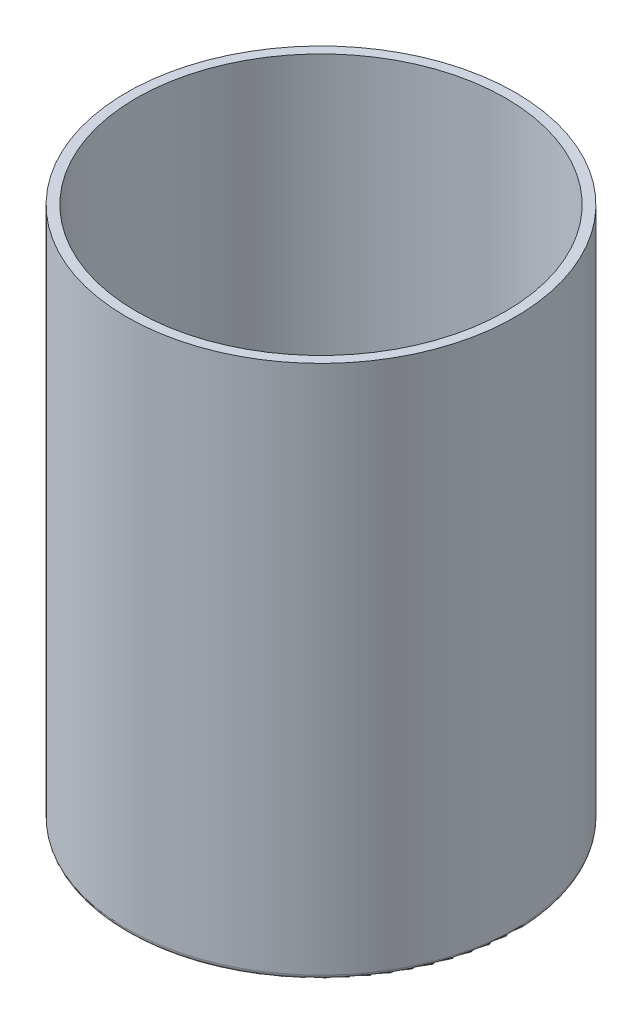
from build123d import *

# Parameters (mm, degrees)
CROQUIS1_R              = 40
SALIENTE_EXTRUIR1_DEPTH = 110
VACIADO1_T              = -2
REDONDEO1_R             = 1


with BuildPart() as part:
    # Croquis1 → Saliente-Extruir1 (new body)
    with BuildSketch(Plane(origin=(0, 0, 0), x_dir=(1, 0, 0), z_dir=(0, 1, 0))):
        with Locations(Location((0, 0, 0), (0, 0, 270))):
            Circle(CROQUIS1_R)
    extrude(amount=-SALIENTE_EXTRUIR1_DEPTH)

    # Vaciado1
    vaciado1_openings = [part.faces().sort_by_distance(p)[0] for p in [
        (0, 0, 0),
    ]]
    offset(amount=VACIADO1_T, openings=vaciado1_openings, kind=Kind.INTERSECTION)

    # Redondeo1
    redondeo1_edges = [part.edges().sort_by_distance(p)[0] for p in [
        (0, -110, -40),
    ]]
    fillet(redondeo1_edges, radius=REDONDEO1_R)


solid = part.part
